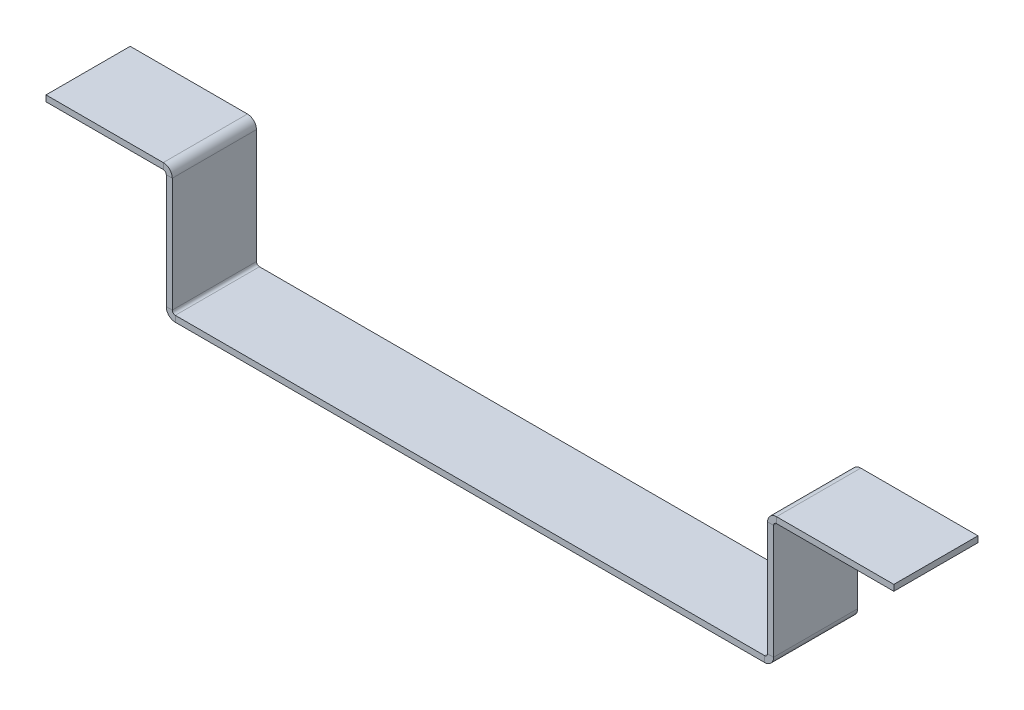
ISO-10303-21;
HEADER;
FILE_DESCRIPTION(('STEP AP214'),'2;1');
FILE_NAME('part.step','',(''),(''),'','','');
FILE_SCHEMA(('AUTOMOTIVE_DESIGN { 1 0 10303 214 1 1 1 1 }'));
ENDSEC;
DATA;
#1=APPLICATION_CONTEXT('core data for automotive mechanical design processes');
#2=APPLICATION_PROTOCOL_DEFINITION('international standard','automotive_design',2000,#1);
#3=PRODUCT_CONTEXT('',#1,'mechanical');
#4=PRODUCT('Part','Part','',(#3));
#5=PRODUCT_RELATED_PRODUCT_CATEGORY('part','',(#4));
#6=PRODUCT_DEFINITION_FORMATION('','',#4);
#7=PRODUCT_DEFINITION_CONTEXT('part definition',#1,'design');
#8=PRODUCT_DEFINITION('design','',#6,#7);
#9=PRODUCT_DEFINITION_SHAPE('','',#8);
#10=(LENGTH_UNIT() NAMED_UNIT(*) SI_UNIT(.MILLI.,.METRE.));
#11=(NAMED_UNIT(*) PLANE_ANGLE_UNIT() SI_UNIT($,.RADIAN.));
#12=(NAMED_UNIT(*) SI_UNIT($,.STERADIAN.) SOLID_ANGLE_UNIT());
#13=UNCERTAINTY_MEASURE_WITH_UNIT(LENGTH_MEASURE(1.E-05),#10,'distance_accuracy_value','');
#14=(GEOMETRIC_REPRESENTATION_CONTEXT(3) GLOBAL_UNCERTAINTY_ASSIGNED_CONTEXT((#13)) GLOBAL_UNIT_ASSIGNED_CONTEXT((#10,
#11,#12)) REPRESENTATION_CONTEXT('',''));
#15=CARTESIAN_POINT('',(0.,0.,0.));
#16=DIRECTION('',(0.,0.,1.));
#17=DIRECTION('',(1.,0.,0.));
#18=AXIS2_PLACEMENT_3D('',#15,#16,#17);
#19=CARTESIAN_POINT('',(50.5,20.5,14.0000000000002));
#20=DIRECTION('',(0.,0.,1.));
#21=DIRECTION('',(1.,0.,0.));
#22=AXIS2_PLACEMENT_3D('',#19,#20,#21);
#23=PLANE('',#22);
#24=DIRECTION('',(-1.,0.,0.));
#25=VECTOR('',#24,1.);
#26=CARTESIAN_POINT('',(50.5,20.5,14.0000000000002));
#27=LINE('',#26,#25);
#28=CARTESIAN_POINT('',(50.5,20.5,14.0000000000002));
#29=VERTEX_POINT('',#28);
#30=CARTESIAN_POINT('',(49.5,20.5,14.0000000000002));
#31=VERTEX_POINT('',#30);
#32=EDGE_CURVE('E11',#29,#31,#27,.T.);
#33=ORIENTED_EDGE('',*,*,#32,.F.);
#34=CARTESIAN_POINT('',(51.,20.5,14.0000000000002));
#35=DIRECTION('',(0.,0.,-1.));
#36=DIRECTION('',(-1.,0.,0.));
#37=AXIS2_PLACEMENT_3D('',#34,#35,#36);
#38=CIRCLE('',#37,0.5);
#39=CARTESIAN_POINT('',(51.,21.,14.0000000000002));
#40=VERTEX_POINT('',#39);
#41=EDGE_CURVE('E594',#40,#29,#38,.F.);
#42=ORIENTED_EDGE('',*,*,#41,.F.);
#43=DIRECTION('',(0.,-1.,0.));
#44=VECTOR('',#43,1.);
#45=CARTESIAN_POINT('',(51.,22.,14.0000000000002));
#46=LINE('',#45,#44);
#47=CARTESIAN_POINT('',(51.,22.,14.0000000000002));
#48=VERTEX_POINT('',#47);
#49=EDGE_CURVE('E363',#48,#40,#46,.T.);
#50=ORIENTED_EDGE('',*,*,#49,.F.);
#51=CARTESIAN_POINT('',(51.,20.5,14.0000000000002));
#52=DIRECTION('',(0.,0.,1.));
#53=DIRECTION('',(1.,0.,0.));
#54=AXIS2_PLACEMENT_3D('',#51,#52,#53);
#55=CIRCLE('',#54,1.5);
#56=EDGE_CURVE('E606',#48,#31,#55,.T.);
#57=ORIENTED_EDGE('',*,*,#56,.T.);
#58=EDGE_LOOP('',(#33,#42,#50,#57));
#59=FACE_BOUND('',#58,.T.);
#60=ADVANCED_FACE('F356',(#59),#23,.T.);
#61=CARTESIAN_POINT('',(51.,22.,14.0000000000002));
#62=DIRECTION('',(0.,0.,1.));
#63=DIRECTION('',(1.,0.,0.));
#64=AXIS2_PLACEMENT_3D('',#61,#62,#63);
#65=PLANE('',#64);
#66=DIRECTION('',(0.,-1.,0.));
#67=VECTOR('',#66,1.);
#68=CARTESIAN_POINT('',(50.5,0.,14.));
#69=LINE('',#68,#67);
#70=CARTESIAN_POINT('',(50.5,1.5,14.0000000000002));
#71=VERTEX_POINT('',#70);
#72=EDGE_CURVE('E591',#29,#71,#69,.T.);
#73=ORIENTED_EDGE('',*,*,#72,.F.);
#74=ORIENTED_EDGE('',*,*,#32,.T.);
#75=DIRECTION('',(0.,1.,0.));
#76=VECTOR('',#75,1.);
#77=CARTESIAN_POINT('',(49.5,0.,14.));
#78=LINE('',#77,#76);
#79=CARTESIAN_POINT('',(49.5,1.5,14.));
#80=VERTEX_POINT('',#79);
#81=EDGE_CURVE('E609',#31,#80,#78,.F.);
#82=ORIENTED_EDGE('',*,*,#81,.T.);
#83=DIRECTION('',(1.,0.,0.));
#84=VECTOR('',#83,1.);
#85=CARTESIAN_POINT('',(49.5,1.5,14.));
#86=LINE('',#85,#84);
#87=EDGE_CURVE('E693',#80,#71,#86,.T.);
#88=ORIENTED_EDGE('',*,*,#87,.T.);
#89=EDGE_LOOP('',(#73,#74,#82,#88));
#90=FACE_BOUND('',#89,.T.);
#91=ADVANCED_FACE('F735',(#90),#65,.T.);
#92=CARTESIAN_POINT('',(51.,21.,1.66533453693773E-13));
#93=DIRECTION('',(0.,0.,-1.));
#94=DIRECTION('',(-1.,0.,0.));
#95=AXIS2_PLACEMENT_3D('',#92,#93,#94);
#96=PLANE('',#95);
#97=DIRECTION('',(0.,1.,0.));
#98=VECTOR('',#97,1.);
#99=CARTESIAN_POINT('',(51.,21.,1.66533453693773E-13));
#100=LINE('',#99,#98);
#101=CARTESIAN_POINT('',(51.,21.,1.66533453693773E-13));
#102=VERTEX_POINT('',#101);
#103=CARTESIAN_POINT('',(51.,22.,1.66533453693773E-13));
#104=VERTEX_POINT('',#103);
#105=EDGE_CURVE('E699',#102,#104,#100,.T.);
#106=ORIENTED_EDGE('',*,*,#105,.F.);
#107=CARTESIAN_POINT('',(51.,20.5,1.66533453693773E-13));
#108=DIRECTION('',(0.,0.,-1.));
#109=DIRECTION('',(-1.,0.,0.));
#110=AXIS2_PLACEMENT_3D('',#107,#108,#109);
#111=CIRCLE('',#110,0.5);
#112=CARTESIAN_POINT('',(50.5,20.5,1.66533453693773E-13));
#113=VERTEX_POINT('',#112);
#114=EDGE_CURVE('E537',#102,#113,#111,.F.);
#115=ORIENTED_EDGE('',*,*,#114,.T.);
#116=DIRECTION('',(1.,0.,0.));
#117=VECTOR('',#116,1.);
#118=CARTESIAN_POINT('',(49.5,20.5,1.66533453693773E-13));
#119=LINE('',#118,#117);
#120=CARTESIAN_POINT('',(49.5,20.5,1.66533453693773E-13));
#121=VERTEX_POINT('',#120);
#122=EDGE_CURVE('E697',#121,#113,#119,.T.);
#123=ORIENTED_EDGE('',*,*,#122,.F.);
#124=CARTESIAN_POINT('',(51.,20.5,1.66533453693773E-13));
#125=DIRECTION('',(0.,0.,1.));
#126=DIRECTION('',(1.,0.,0.));
#127=AXIS2_PLACEMENT_3D('',#124,#125,#126);
#128=CIRCLE('',#127,1.5);
#129=EDGE_CURVE('E549',#104,#121,#128,.T.);
#130=ORIENTED_EDGE('',*,*,#129,.F.);
#131=EDGE_LOOP('',(#106,#115,#123,#130));
#132=FACE_BOUND('',#131,.T.);
#133=ADVANCED_FACE('F743',(#132),#96,.T.);
#134=CARTESIAN_POINT('',(49.5,20.5,1.66533453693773E-13));
#135=DIRECTION('',(0.,0.,-1.));
#136=DIRECTION('',(-1.,0.,0.));
#137=AXIS2_PLACEMENT_3D('',#134,#135,#136);
#138=PLANE('',#137);
#139=DIRECTION('',(-1.,0.,0.));
#140=VECTOR('',#139,1.);
#141=CARTESIAN_POINT('',(50.5,21.,1.66533453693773E-13));
#142=LINE('',#141,#140);
#143=CARTESIAN_POINT('',(70.5,21.,1.66533453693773E-13));
#144=VERTEX_POINT('',#143);
#145=EDGE_CURVE('E540',#144,#102,#142,.T.);
#146=ORIENTED_EDGE('',*,*,#145,.T.);
#147=ORIENTED_EDGE('',*,*,#105,.T.);
#148=DIRECTION('',(1.,0.,0.));
#149=VECTOR('',#148,1.);
#150=CARTESIAN_POINT('',(50.5,22.,1.66533453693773E-13));
#151=LINE('',#150,#149);
#152=CARTESIAN_POINT('',(70.5,22.,1.66533453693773E-13));
#153=VERTEX_POINT('',#152);
#154=EDGE_CURVE('E546',#153,#104,#151,.F.);
#155=ORIENTED_EDGE('',*,*,#154,.F.);
#156=DIRECTION('',(0.,-1.,0.));
#157=VECTOR('',#156,1.);
#158=CARTESIAN_POINT('',(70.5,22.,1.66533453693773E-13));
#159=LINE('',#158,#157);
#160=EDGE_CURVE('E543',#153,#144,#159,.T.);
#161=ORIENTED_EDGE('',*,*,#160,.T.);
#162=EDGE_LOOP('',(#146,#147,#155,#161));
#163=FACE_BOUND('',#162,.T.);
#164=ADVANCED_FACE('F745',(#163),#138,.T.);
#165=CARTESIAN_POINT('',(48.9999999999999,0.,14.));
#166=DIRECTION('',(0.,0.,1.));
#167=DIRECTION('',(1.,0.,0.));
#168=AXIS2_PLACEMENT_3D('',#165,#166,#167);
#169=PLANE('',#168);
#170=DIRECTION('',(0.,1.,0.));
#171=VECTOR('',#170,1.);
#172=CARTESIAN_POINT('',(48.9999999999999,0.,14.));
#173=LINE('',#172,#171);
#174=CARTESIAN_POINT('',(48.9999999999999,0.,14.));
#175=VERTEX_POINT('',#174);
#176=CARTESIAN_POINT('',(48.9999999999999,1.,14.));
#177=VERTEX_POINT('',#176);
#178=EDGE_CURVE('E695',#175,#177,#173,.T.);
#179=ORIENTED_EDGE('',*,*,#178,.F.);
#180=CARTESIAN_POINT('',(49.,1.5,14.));
#181=DIRECTION('',(0.,0.,1.));
#182=DIRECTION('',(1.,0.,0.));
#183=AXIS2_PLACEMENT_3D('',#180,#181,#182);
#184=CIRCLE('',#183,1.5);
#185=EDGE_CURVE('E588',#71,#175,#184,.F.);
#186=ORIENTED_EDGE('',*,*,#185,.F.);
#187=ORIENTED_EDGE('',*,*,#87,.F.);
#188=CARTESIAN_POINT('',(49.,1.5,14.));
#189=DIRECTION('',(0.,0.,1.));
#190=DIRECTION('',(1.,0.,0.));
#191=AXIS2_PLACEMENT_3D('',#188,#189,#190);
#192=CIRCLE('',#191,0.5);
#193=EDGE_CURVE('E612',#80,#177,#192,.F.);
#194=ORIENTED_EDGE('',*,*,#193,.T.);
#195=EDGE_LOOP('',(#179,#186,#187,#194));
#196=FACE_BOUND('',#195,.T.);
#197=ADVANCED_FACE('F747',(#196),#169,.T.);
#198=CARTESIAN_POINT('',(49.5,1.5,14.));
#199=DIRECTION('',(0.,0.,1.));
#200=DIRECTION('',(1.,0.,0.));
#201=AXIS2_PLACEMENT_3D('',#198,#199,#200);
#202=PLANE('',#201);
#203=DIRECTION('',(-1.,0.,0.));
#204=VECTOR('',#203,1.);
#205=CARTESIAN_POINT('',(-50.5,0.,14.));
#206=LINE('',#205,#204);
#207=CARTESIAN_POINT('',(-49.,0.,14.));
#208=VERTEX_POINT('',#207);
#209=EDGE_CURVE('E585',#175,#208,#206,.T.);
#210=ORIENTED_EDGE('',*,*,#209,.F.);
#211=ORIENTED_EDGE('',*,*,#178,.T.);
#212=DIRECTION('',(-1.,0.,0.));
#213=VECTOR('',#212,1.);
#214=CARTESIAN_POINT('',(-50.5,1.,14.));
#215=LINE('',#214,#213);
#216=CARTESIAN_POINT('',(-49.,1.,14.));
#217=VERTEX_POINT('',#216);
#218=EDGE_CURVE('E615',#177,#217,#215,.T.);
#219=ORIENTED_EDGE('',*,*,#218,.T.);
#220=DIRECTION('',(0.,-1.,0.));
#221=VECTOR('',#220,1.);
#222=CARTESIAN_POINT('',(-49.,1.,14.));
#223=LINE('',#222,#221);
#224=EDGE_CURVE('E685',#217,#208,#223,.T.);
#225=ORIENTED_EDGE('',*,*,#224,.T.);
#226=EDGE_LOOP('',(#210,#211,#219,#225));
#227=FACE_BOUND('',#226,.T.);
#228=ADVANCED_FACE('F753',(#227),#202,.T.);
#229=CARTESIAN_POINT('',(50.5,1.5,1.66533453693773E-13));
#230=DIRECTION('',(0.,0.,-1.));
#231=DIRECTION('',(-1.,0.,0.));
#232=AXIS2_PLACEMENT_3D('',#229,#230,#231);
#233=PLANE('',#232);
#234=DIRECTION('',(-1.,0.,0.));
#235=VECTOR('',#234,1.);
#236=CARTESIAN_POINT('',(50.5,1.5,1.66533453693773E-13));
#237=LINE('',#236,#235);
#238=CARTESIAN_POINT('',(50.5,1.5,1.66533453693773E-13));
#239=VERTEX_POINT('',#238);
#240=CARTESIAN_POINT('',(49.5,1.5,1.66533453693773E-13));
#241=VERTEX_POINT('',#240);
#242=EDGE_CURVE('E691',#239,#241,#237,.T.);
#243=ORIENTED_EDGE('',*,*,#242,.F.);
#244=CARTESIAN_POINT('',(49.,1.5,1.66533453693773E-13));
#245=DIRECTION('',(0.,0.,1.));
#246=DIRECTION('',(1.,0.,0.));
#247=AXIS2_PLACEMENT_3D('',#244,#245,#246);
#248=CIRCLE('',#247,1.5);
#249=CARTESIAN_POINT('',(48.9999999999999,0.,0.));
#250=VERTEX_POINT('',#249);
#251=EDGE_CURVE('E531',#239,#250,#248,.F.);
#252=ORIENTED_EDGE('',*,*,#251,.T.);
#253=DIRECTION('',(0.,-1.,0.));
#254=VECTOR('',#253,1.);
#255=CARTESIAN_POINT('',(48.9999999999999,1.,0.));
#256=LINE('',#255,#254);
#257=CARTESIAN_POINT('',(48.9999999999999,1.,0.));
#258=VERTEX_POINT('',#257);
#259=EDGE_CURVE('E689',#258,#250,#256,.T.);
#260=ORIENTED_EDGE('',*,*,#259,.F.);
#261=CARTESIAN_POINT('',(49.,1.5,1.66533453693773E-13));
#262=DIRECTION('',(0.,0.,1.));
#263=DIRECTION('',(1.,0.,0.));
#264=AXIS2_PLACEMENT_3D('',#261,#262,#263);
#265=CIRCLE('',#264,0.5);
#266=EDGE_CURVE('E555',#241,#258,#265,.F.);
#267=ORIENTED_EDGE('',*,*,#266,.F.);
#268=EDGE_LOOP('',(#243,#252,#260,#267));
#269=FACE_BOUND('',#268,.T.);
#270=ADVANCED_FACE('F792',(#269),#233,.T.);
#271=CARTESIAN_POINT('',(48.9999999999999,1.,0.));
#272=DIRECTION('',(0.,0.,-1.));
#273=DIRECTION('',(-1.,0.,0.));
#274=AXIS2_PLACEMENT_3D('',#271,#272,#273);
#275=PLANE('',#274);
#276=DIRECTION('',(0.,-1.,0.));
#277=VECTOR('',#276,1.);
#278=CARTESIAN_POINT('',(50.5,0.,0.));
#279=LINE('',#278,#277);
#280=EDGE_CURVE('E534',#113,#239,#279,.T.);
#281=ORIENTED_EDGE('',*,*,#280,.T.);
#282=ORIENTED_EDGE('',*,*,#242,.T.);
#283=DIRECTION('',(0.,1.,0.));
#284=VECTOR('',#283,1.);
#285=CARTESIAN_POINT('',(49.5,0.,0.));
#286=LINE('',#285,#284);
#287=EDGE_CURVE('E552',#121,#241,#286,.F.);
#288=ORIENTED_EDGE('',*,*,#287,.F.);
#289=ORIENTED_EDGE('',*,*,#122,.T.);
#290=EDGE_LOOP('',(#281,#282,#288,#289));
#291=FACE_BOUND('',#290,.T.);
#292=ADVANCED_FACE('F802',(#291),#275,.T.);
#293=CARTESIAN_POINT('',(-50.5,1.5,14.));
#294=DIRECTION('',(0.,0.,1.));
#295=DIRECTION('',(1.,0.,0.));
#296=AXIS2_PLACEMENT_3D('',#293,#294,#295);
#297=PLANE('',#296);
#298=DIRECTION('',(1.,0.,0.));
#299=VECTOR('',#298,1.);
#300=CARTESIAN_POINT('',(-50.5,1.5,14.));
#301=LINE('',#300,#299);
#302=CARTESIAN_POINT('',(-50.5,1.5,14.));
#303=VERTEX_POINT('',#302);
#304=CARTESIAN_POINT('',(-49.5,1.5,14.));
#305=VERTEX_POINT('',#304);
#306=EDGE_CURVE('E687',#303,#305,#301,.T.);
#307=ORIENTED_EDGE('',*,*,#306,.F.);
#308=CARTESIAN_POINT('',(-49.,1.5,14.));
#309=DIRECTION('',(0.,0.,1.));
#310=DIRECTION('',(1.,0.,0.));
#311=AXIS2_PLACEMENT_3D('',#308,#309,#310);
#312=CIRCLE('',#311,1.5);
#313=EDGE_CURVE('E582',#208,#303,#312,.F.);
#314=ORIENTED_EDGE('',*,*,#313,.F.);
#315=ORIENTED_EDGE('',*,*,#224,.F.);
#316=CARTESIAN_POINT('',(-49.,1.5,14.));
#317=DIRECTION('',(0.,0.,1.));
#318=DIRECTION('',(1.,0.,0.));
#319=AXIS2_PLACEMENT_3D('',#316,#317,#318);
#320=CIRCLE('',#319,0.5);
#321=EDGE_CURVE('E618',#217,#305,#320,.F.);
#322=ORIENTED_EDGE('',*,*,#321,.T.);
#323=EDGE_LOOP('',(#307,#314,#315,#322));
#324=FACE_BOUND('',#323,.T.);
#325=ADVANCED_FACE('F812',(#324),#297,.T.);
#326=CARTESIAN_POINT('',(-49.,1.,14.));
#327=DIRECTION('',(0.,0.,1.));
#328=DIRECTION('',(1.,0.,0.));
#329=AXIS2_PLACEMENT_3D('',#326,#327,#328);
#330=PLANE('',#329);
#331=DIRECTION('',(0.,1.,0.));
#332=VECTOR('',#331,1.);
#333=CARTESIAN_POINT('',(-50.5,0.,14.));
#334=LINE('',#333,#332);
#335=CARTESIAN_POINT('',(-50.5,20.5,14.));
#336=VERTEX_POINT('',#335);
#337=EDGE_CURVE('E579',#303,#336,#334,.T.);
#338=ORIENTED_EDGE('',*,*,#337,.F.);
#339=ORIENTED_EDGE('',*,*,#306,.T.);
#340=DIRECTION('',(0.,1.,0.));
#341=VECTOR('',#340,1.);
#342=CARTESIAN_POINT('',(-49.5,0.,14.));
#343=LINE('',#342,#341);
#344=CARTESIAN_POINT('',(-49.5,20.5,14.));
#345=VERTEX_POINT('',#344);
#346=EDGE_CURVE('E621',#305,#345,#343,.T.);
#347=ORIENTED_EDGE('',*,*,#346,.T.);
#348=DIRECTION('',(-1.,0.,0.));
#349=VECTOR('',#348,1.);
#350=CARTESIAN_POINT('',(-49.5,20.5,14.));
#351=LINE('',#350,#349);
#352=EDGE_CURVE('E377',#345,#336,#351,.T.);
#353=ORIENTED_EDGE('',*,*,#352,.T.);
#354=EDGE_LOOP('',(#338,#339,#347,#353));
#355=FACE_BOUND('',#354,.T.);
#356=ADVANCED_FACE('F822',(#355),#330,.T.);
#357=CARTESIAN_POINT('',(-49.,0.,0.));
#358=DIRECTION('',(0.,0.,-1.));
#359=DIRECTION('',(-1.,0.,0.));
#360=AXIS2_PLACEMENT_3D('',#357,#358,#359);
#361=PLANE('',#360);
#362=DIRECTION('',(0.,1.,0.));
#363=VECTOR('',#362,1.);
#364=CARTESIAN_POINT('',(-49.,0.,0.));
#365=LINE('',#364,#363);
#366=CARTESIAN_POINT('',(-49.,0.,0.));
#367=VERTEX_POINT('',#366);
#368=CARTESIAN_POINT('',(-49.,1.,0.));
#369=VERTEX_POINT('',#368);
#370=EDGE_CURVE('E683',#367,#369,#365,.T.);
#371=ORIENTED_EDGE('',*,*,#370,.F.);
#372=CARTESIAN_POINT('',(-49.,1.5,0.));
#373=DIRECTION('',(0.,0.,1.));
#374=DIRECTION('',(1.,0.,0.));
#375=AXIS2_PLACEMENT_3D('',#372,#373,#374);
#376=CIRCLE('',#375,1.5);
#377=CARTESIAN_POINT('',(-50.5,1.5,0.));
#378=VERTEX_POINT('',#377);
#379=EDGE_CURVE('E525',#367,#378,#376,.F.);
#380=ORIENTED_EDGE('',*,*,#379,.T.);
#381=DIRECTION('',(-1.,0.,0.));
#382=VECTOR('',#381,1.);
#383=CARTESIAN_POINT('',(-49.5,1.5,0.));
#384=LINE('',#383,#382);
#385=CARTESIAN_POINT('',(-49.5,1.5,0.));
#386=VERTEX_POINT('',#385);
#387=EDGE_CURVE('E681',#386,#378,#384,.T.);
#388=ORIENTED_EDGE('',*,*,#387,.F.);
#389=CARTESIAN_POINT('',(-49.,1.5,0.));
#390=DIRECTION('',(0.,0.,1.));
#391=DIRECTION('',(1.,0.,0.));
#392=AXIS2_PLACEMENT_3D('',#389,#390,#391);
#393=CIRCLE('',#392,0.5);
#394=EDGE_CURVE('E561',#369,#386,#393,.F.);
#395=ORIENTED_EDGE('',*,*,#394,.F.);
#396=EDGE_LOOP('',(#371,#380,#388,#395));
#397=FACE_BOUND('',#396,.T.);
#398=ADVANCED_FACE('F833',(#397),#361,.T.);
#399=CARTESIAN_POINT('',(-49.5,1.5,0.));
#400=DIRECTION('',(0.,0.,-1.));
#401=DIRECTION('',(-1.,0.,0.));
#402=AXIS2_PLACEMENT_3D('',#399,#400,#401);
#403=PLANE('',#402);
#404=DIRECTION('',(-1.,0.,0.));
#405=VECTOR('',#404,1.);
#406=CARTESIAN_POINT('',(-50.5,0.,0.));
#407=LINE('',#406,#405);
#408=EDGE_CURVE('E528',#250,#367,#407,.T.);
#409=ORIENTED_EDGE('',*,*,#408,.T.);
#410=ORIENTED_EDGE('',*,*,#370,.T.);
#411=DIRECTION('',(-1.,0.,0.));
#412=VECTOR('',#411,1.);
#413=CARTESIAN_POINT('',(-50.5,1.,0.));
#414=LINE('',#413,#412);
#415=EDGE_CURVE('E558',#258,#369,#414,.T.);
#416=ORIENTED_EDGE('',*,*,#415,.F.);
#417=ORIENTED_EDGE('',*,*,#259,.T.);
#418=EDGE_LOOP('',(#409,#410,#416,#417));
#419=FACE_BOUND('',#418,.T.);
#420=ADVANCED_FACE('F843',(#419),#403,.T.);
#421=CARTESIAN_POINT('',(-51.,21.,14.));
#422=DIRECTION('',(0.,0.,1.));
#423=DIRECTION('',(1.,0.,0.));
#424=AXIS2_PLACEMENT_3D('',#421,#422,#423);
#425=PLANE('',#424);
#426=DIRECTION('',(0.,1.,0.));
#427=VECTOR('',#426,1.);
#428=CARTESIAN_POINT('',(-51.,21.,14.));
#429=LINE('',#428,#427);
#430=CARTESIAN_POINT('',(-51.,21.,14.));
#431=VERTEX_POINT('',#430);
#432=CARTESIAN_POINT('',(-51.,22.,14.));
#433=VERTEX_POINT('',#432);
#434=EDGE_CURVE('E370',#431,#433,#429,.T.);
#435=ORIENTED_EDGE('',*,*,#434,.F.);
#436=CARTESIAN_POINT('',(-51.,20.5,14.));
#437=DIRECTION('',(0.,0.,-1.));
#438=DIRECTION('',(-1.,0.,0.));
#439=AXIS2_PLACEMENT_3D('',#436,#437,#438);
#440=CIRCLE('',#439,0.5);
#441=EDGE_CURVE('E576',#336,#431,#440,.F.);
#442=ORIENTED_EDGE('',*,*,#441,.F.);
#443=ORIENTED_EDGE('',*,*,#352,.F.);
#444=CARTESIAN_POINT('',(-51.,20.5,14.));
#445=DIRECTION('',(0.,0.,1.));
#446=DIRECTION('',(1.,0.,0.));
#447=AXIS2_PLACEMENT_3D('',#444,#445,#446);
#448=CIRCLE('',#447,1.5);
#449=EDGE_CURVE('E623',#345,#433,#448,.T.);
#450=ORIENTED_EDGE('',*,*,#449,.T.);
#451=EDGE_LOOP('',(#435,#442,#443,#450));
#452=FACE_BOUND('',#451,.T.);
#453=ADVANCED_FACE('F853',(#452),#425,.T.);
#454=CARTESIAN_POINT('',(-49.5,20.5,14.));
#455=DIRECTION('',(0.,0.,1.));
#456=DIRECTION('',(1.,0.,0.));
#457=AXIS2_PLACEMENT_3D('',#454,#455,#456);
#458=PLANE('',#457);
#459=DIRECTION('',(-1.,0.,0.));
#460=VECTOR('',#459,1.);
#461=CARTESIAN_POINT('',(-50.5,21.,14.));
#462=LINE('',#461,#460);
#463=CARTESIAN_POINT('',(-70.5,21.,14.));
#464=VERTEX_POINT('',#463);
#465=EDGE_CURVE('E573',#431,#464,#462,.T.);
#466=ORIENTED_EDGE('',*,*,#465,.F.);
#467=ORIENTED_EDGE('',*,*,#434,.T.);
#468=DIRECTION('',(-1.,0.,0.));
#469=VECTOR('',#468,1.);
#470=CARTESIAN_POINT('',(-50.5,22.,14.));
#471=LINE('',#470,#469);
#472=CARTESIAN_POINT('',(-70.5,22.,14.));
#473=VERTEX_POINT('',#472);
#474=EDGE_CURVE('E570',#433,#473,#471,.T.);
#475=ORIENTED_EDGE('',*,*,#474,.T.);
#476=DIRECTION('',(0.,1.,0.));
#477=VECTOR('',#476,1.);
#478=CARTESIAN_POINT('',(-70.5,21.,14.));
#479=LINE('',#478,#477);
#480=EDGE_CURVE('E499',#464,#473,#479,.T.);
#481=ORIENTED_EDGE('',*,*,#480,.F.);
#482=EDGE_LOOP('',(#466,#467,#475,#481));
#483=FACE_BOUND('',#482,.T.);
#484=ADVANCED_FACE('F864',(#483),#458,.T.);
#485=CARTESIAN_POINT('',(-50.5,20.5,0.));
#486=DIRECTION('',(0.,0.,-1.));
#487=DIRECTION('',(-1.,0.,0.));
#488=AXIS2_PLACEMENT_3D('',#485,#486,#487);
#489=PLANE('',#488);
#490=DIRECTION('',(1.,0.,0.));
#491=VECTOR('',#490,1.);
#492=CARTESIAN_POINT('',(-50.5,20.5,0.));
#493=LINE('',#492,#491);
#494=CARTESIAN_POINT('',(-50.5,20.5,0.));
#495=VERTEX_POINT('',#494);
#496=CARTESIAN_POINT('',(-49.5,20.5,0.));
#497=VERTEX_POINT('',#496);
#498=EDGE_CURVE('E677',#495,#497,#493,.T.);
#499=ORIENTED_EDGE('',*,*,#498,.F.);
#500=CARTESIAN_POINT('',(-51.,20.5,0.));
#501=DIRECTION('',(0.,0.,-1.));
#502=DIRECTION('',(-1.,0.,0.));
#503=AXIS2_PLACEMENT_3D('',#500,#501,#502);
#504=CIRCLE('',#503,0.5);
#505=CARTESIAN_POINT('',(-51.,21.,0.));
#506=VERTEX_POINT('',#505);
#507=EDGE_CURVE('E517',#495,#506,#504,.F.);
#508=ORIENTED_EDGE('',*,*,#507,.T.);
#509=DIRECTION('',(0.,-1.,0.));
#510=VECTOR('',#509,1.);
#511=CARTESIAN_POINT('',(-51.,22.,0.));
#512=LINE('',#511,#510);
#513=CARTESIAN_POINT('',(-51.,22.,0.));
#514=VERTEX_POINT('',#513);
#515=EDGE_CURVE('E502',#514,#506,#512,.T.);
#516=ORIENTED_EDGE('',*,*,#515,.F.);
#517=CARTESIAN_POINT('',(-51.,20.5,0.));
#518=DIRECTION('',(0.,0.,1.));
#519=DIRECTION('',(1.,0.,0.));
#520=AXIS2_PLACEMENT_3D('',#517,#518,#519);
#521=CIRCLE('',#520,1.5);
#522=EDGE_CURVE('E567',#497,#514,#521,.T.);
#523=ORIENTED_EDGE('',*,*,#522,.F.);
#524=EDGE_LOOP('',(#499,#508,#516,#523));
#525=FACE_BOUND('',#524,.T.);
#526=ADVANCED_FACE('F874',(#525),#489,.T.);
#527=CARTESIAN_POINT('',(-51.,22.,0.));
#528=DIRECTION('',(0.,0.,-1.));
#529=DIRECTION('',(-1.,0.,0.));
#530=AXIS2_PLACEMENT_3D('',#527,#528,#529);
#531=PLANE('',#530);
#532=DIRECTION('',(0.,1.,0.));
#533=VECTOR('',#532,1.);
#534=CARTESIAN_POINT('',(-50.5,0.,0.));
#535=LINE('',#534,#533);
#536=EDGE_CURVE('E522',#378,#495,#535,.T.);
#537=ORIENTED_EDGE('',*,*,#536,.T.);
#538=ORIENTED_EDGE('',*,*,#498,.T.);
#539=DIRECTION('',(0.,1.,0.));
#540=VECTOR('',#539,1.);
#541=CARTESIAN_POINT('',(-49.5,0.,0.));
#542=LINE('',#541,#540);
#543=EDGE_CURVE('E564',#386,#497,#542,.T.);
#544=ORIENTED_EDGE('',*,*,#543,.F.);
#545=ORIENTED_EDGE('',*,*,#387,.T.);
#546=EDGE_LOOP('',(#537,#538,#544,#545));
#547=FACE_BOUND('',#546,.T.);
#548=ADVANCED_FACE('F883',(#547),#531,.T.);
#549=CARTESIAN_POINT('',(-50.5,22.,14.));
#550=DIRECTION('',(0.,-1.,0.));
#551=DIRECTION('',(1.,0.,0.));
#552=AXIS2_PLACEMENT_3D('',#549,#550,#551);
#553=PLANE('',#552);
#554=DIRECTION('',(-1.,0.,0.));
#555=VECTOR('',#554,1.);
#556=CARTESIAN_POINT('',(-50.5,22.,0.));
#557=LINE('',#556,#555);
#558=CARTESIAN_POINT('',(-70.5,22.,0.));
#559=VERTEX_POINT('',#558);
#560=EDGE_CURVE('E507',#514,#559,#557,.T.);
#561=ORIENTED_EDGE('',*,*,#560,.T.);
#562=DIRECTION('',(0.,0.,-1.));
#563=VECTOR('',#562,1.);
#564=CARTESIAN_POINT('',(-70.5,22.,14.));
#565=LINE('',#564,#563);
#566=EDGE_CURVE('E492',#473,#559,#565,.T.);
#567=ORIENTED_EDGE('',*,*,#566,.F.);
#568=ORIENTED_EDGE('',*,*,#474,.F.);
#569=DIRECTION('',(0.,0.,-1.));
#570=VECTOR('',#569,1.);
#571=CARTESIAN_POINT('',(-51.,22.,14.));
#572=LINE('',#571,#570);
#573=EDGE_CURVE('E510',#433,#514,#572,.T.);
#574=ORIENTED_EDGE('',*,*,#573,.T.);
#575=EDGE_LOOP('',(#561,#567,#568,#574));
#576=FACE_BOUND('',#575,.T.);
#577=ADVANCED_FACE('F508',(#576),#553,.F.);
#578=CARTESIAN_POINT('',(-70.5,21.,14.));
#579=DIRECTION('',(-1.,0.,0.));
#580=DIRECTION('',(0.,0.,1.));
#581=AXIS2_PLACEMENT_3D('',#578,#579,#580);
#582=PLANE('',#581);
#583=DIRECTION('',(0.,1.,0.));
#584=VECTOR('',#583,1.);
#585=CARTESIAN_POINT('',(-70.5,21.,0.));
#586=LINE('',#585,#584);
#587=CARTESIAN_POINT('',(-70.5,21.,0.));
#588=VERTEX_POINT('',#587);
#589=EDGE_CURVE('E496',#588,#559,#586,.T.);
#590=ORIENTED_EDGE('',*,*,#589,.F.);
#591=DIRECTION('',(0.,0.,-1.));
#592=VECTOR('',#591,1.);
#593=CARTESIAN_POINT('',(-70.5,21.,14.));
#594=LINE('',#593,#592);
#595=EDGE_CURVE('E503',#464,#588,#594,.T.);
#596=ORIENTED_EDGE('',*,*,#595,.F.);
#597=ORIENTED_EDGE('',*,*,#480,.T.);
#598=ORIENTED_EDGE('',*,*,#566,.T.);
#599=EDGE_LOOP('',(#590,#596,#597,#598));
#600=FACE_BOUND('',#599,.T.);
#601=ADVANCED_FACE('F494',(#600),#582,.T.);
#602=CARTESIAN_POINT('',(-50.5,21.,14.));
#603=DIRECTION('',(0.,-1.,0.));
#604=DIRECTION('',(1.,0.,0.));
#605=AXIS2_PLACEMENT_3D('',#602,#603,#604);
#606=PLANE('',#605);
#607=DIRECTION('',(-1.,0.,0.));
#608=VECTOR('',#607,1.);
#609=CARTESIAN_POINT('',(-50.5,21.,0.));
#610=LINE('',#609,#608);
#611=EDGE_CURVE('E515',#506,#588,#610,.T.);
#612=ORIENTED_EDGE('',*,*,#611,.F.);
#613=DIRECTION('',(0.,0.,-1.));
#614=VECTOR('',#613,1.);
#615=CARTESIAN_POINT('',(-51.,21.,14.));
#616=LINE('',#615,#614);
#617=EDGE_CURVE('E672',#431,#506,#616,.T.);
#618=ORIENTED_EDGE('',*,*,#617,.F.);
#619=ORIENTED_EDGE('',*,*,#465,.T.);
#620=ORIENTED_EDGE('',*,*,#595,.T.);
#621=EDGE_LOOP('',(#612,#618,#619,#620));
#622=FACE_BOUND('',#621,.T.);
#623=ADVANCED_FACE('F910',(#622),#606,.T.);
#624=CARTESIAN_POINT('',(-51.,20.5,14.));
#625=DIRECTION('',(0.,0.,-1.));
#626=DIRECTION('',(-1.,0.,0.));
#627=AXIS2_PLACEMENT_3D('',#624,#625,#626);
#628=CYLINDRICAL_SURFACE('',#627,0.5);
#629=ORIENTED_EDGE('',*,*,#507,.F.);
#630=DIRECTION('',(0.,0.,-1.));
#631=VECTOR('',#630,1.);
#632=CARTESIAN_POINT('',(-50.5,20.5,14.));
#633=LINE('',#632,#631);
#634=EDGE_CURVE('E669',#336,#495,#633,.T.);
#635=ORIENTED_EDGE('',*,*,#634,.F.);
#636=ORIENTED_EDGE('',*,*,#441,.T.);
#637=ORIENTED_EDGE('',*,*,#617,.T.);
#638=EDGE_LOOP('',(#629,#635,#636,#637));
#639=FACE_BOUND('',#638,.T.);
#640=ADVANCED_FACE('F919',(#639),#628,.F.);
#641=CARTESIAN_POINT('',(-50.5,0.,14.));
#642=DIRECTION('',(-1.,0.,0.));
#643=DIRECTION('',(0.,-1.,0.));
#644=AXIS2_PLACEMENT_3D('',#641,#642,#643);
#645=PLANE('',#644);
#646=ORIENTED_EDGE('',*,*,#536,.F.);
#647=DIRECTION('',(0.,0.,-1.));
#648=VECTOR('',#647,1.);
#649=CARTESIAN_POINT('',(-50.5,1.5,14.));
#650=LINE('',#649,#648);
#651=EDGE_CURVE('E666',#303,#378,#650,.T.);
#652=ORIENTED_EDGE('',*,*,#651,.F.);
#653=ORIENTED_EDGE('',*,*,#337,.T.);
#654=ORIENTED_EDGE('',*,*,#634,.T.);
#655=EDGE_LOOP('',(#646,#652,#653,#654));
#656=FACE_BOUND('',#655,.T.);
#657=ADVANCED_FACE('F930',(#656),#645,.T.);
#658=CARTESIAN_POINT('',(-49.,1.5,14.));
#659=DIRECTION('',(0.,0.,-1.));
#660=DIRECTION('',(-1.,0.,0.));
#661=AXIS2_PLACEMENT_3D('',#658,#659,#660);
#662=CYLINDRICAL_SURFACE('',#661,1.5);
#663=ORIENTED_EDGE('',*,*,#379,.F.);
#664=DIRECTION('',(0.,0.,-1.));
#665=VECTOR('',#664,1.);
#666=CARTESIAN_POINT('',(-49.,0.,14.));
#667=LINE('',#666,#665);
#668=EDGE_CURVE('E663',#208,#367,#667,.T.);
#669=ORIENTED_EDGE('',*,*,#668,.F.);
#670=ORIENTED_EDGE('',*,*,#313,.T.);
#671=ORIENTED_EDGE('',*,*,#651,.T.);
#672=EDGE_LOOP('',(#663,#669,#670,#671));
#673=FACE_BOUND('',#672,.T.);
#674=ADVANCED_FACE('F940',(#673),#662,.T.);
#675=CARTESIAN_POINT('',(-50.5,0.,14.));
#676=DIRECTION('',(0.,-1.,0.));
#677=DIRECTION('',(1.,0.,0.));
#678=AXIS2_PLACEMENT_3D('',#675,#676,#677);
#679=PLANE('',#678);
#680=ORIENTED_EDGE('',*,*,#408,.F.);
#681=DIRECTION('',(0.,0.,-1.));
#682=VECTOR('',#681,1.);
#683=CARTESIAN_POINT('',(48.9999999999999,0.,14.));
#684=LINE('',#683,#682);
#685=EDGE_CURVE('E660',#175,#250,#684,.T.);
#686=ORIENTED_EDGE('',*,*,#685,.F.);
#687=ORIENTED_EDGE('',*,*,#209,.T.);
#688=ORIENTED_EDGE('',*,*,#668,.T.);
#689=EDGE_LOOP('',(#680,#686,#687,#688));
#690=FACE_BOUND('',#689,.T.);
#691=ADVANCED_FACE('F950',(#690),#679,.T.);
#692=CARTESIAN_POINT('',(49.,1.5,14.));
#693=DIRECTION('',(0.,0.,-1.));
#694=DIRECTION('',(-1.,0.,0.));
#695=AXIS2_PLACEMENT_3D('',#692,#693,#694);
#696=CYLINDRICAL_SURFACE('',#695,1.5);
#697=ORIENTED_EDGE('',*,*,#251,.F.);
#698=DIRECTION('',(0.,0.,-1.));
#699=VECTOR('',#698,1.);
#700=CARTESIAN_POINT('',(50.5,1.5,14.0000000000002));
#701=LINE('',#700,#699);
#702=EDGE_CURVE('E657',#71,#239,#701,.T.);
#703=ORIENTED_EDGE('',*,*,#702,.F.);
#704=ORIENTED_EDGE('',*,*,#185,.T.);
#705=ORIENTED_EDGE('',*,*,#685,.T.);
#706=EDGE_LOOP('',(#697,#703,#704,#705));
#707=FACE_BOUND('',#706,.T.);
#708=ADVANCED_FACE('F959',(#707),#696,.T.);
#709=CARTESIAN_POINT('',(50.5,0.,14.));
#710=DIRECTION('',(1.,0.,0.));
#711=DIRECTION('',(0.,0.,-1.));
#712=AXIS2_PLACEMENT_3D('',#709,#710,#711);
#713=PLANE('',#712);
#714=ORIENTED_EDGE('',*,*,#280,.F.);
#715=DIRECTION('',(0.,0.,-1.));
#716=VECTOR('',#715,1.);
#717=CARTESIAN_POINT('',(50.5,20.5,14.0000000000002));
#718=LINE('',#717,#716);
#719=EDGE_CURVE('E654',#29,#113,#718,.T.);
#720=ORIENTED_EDGE('',*,*,#719,.F.);
#721=ORIENTED_EDGE('',*,*,#72,.T.);
#722=ORIENTED_EDGE('',*,*,#702,.T.);
#723=EDGE_LOOP('',(#714,#720,#721,#722));
#724=FACE_BOUND('',#723,.T.);
#725=ADVANCED_FACE('F739',(#724),#713,.T.);
#726=CARTESIAN_POINT('',(51.,20.5,14.0000000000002));
#727=DIRECTION('',(0.,0.,-1.));
#728=DIRECTION('',(-1.,0.,0.));
#729=AXIS2_PLACEMENT_3D('',#726,#727,#728);
#730=CYLINDRICAL_SURFACE('',#729,0.5);
#731=ORIENTED_EDGE('',*,*,#114,.F.);
#732=DIRECTION('',(0.,0.,-1.));
#733=VECTOR('',#732,1.);
#734=CARTESIAN_POINT('',(51.,21.,14.0000000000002));
#735=LINE('',#734,#733);
#736=EDGE_CURVE('E651',#40,#102,#735,.T.);
#737=ORIENTED_EDGE('',*,*,#736,.F.);
#738=ORIENTED_EDGE('',*,*,#41,.T.);
#739=ORIENTED_EDGE('',*,*,#719,.T.);
#740=EDGE_LOOP('',(#731,#737,#738,#739));
#741=FACE_BOUND('',#740,.T.);
#742=ADVANCED_FACE('F711',(#741),#730,.F.);
#743=CARTESIAN_POINT('',(50.5,21.,14.0000000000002));
#744=DIRECTION('',(0.,-1.,0.));
#745=DIRECTION('',(0.,0.,-1.));
#746=AXIS2_PLACEMENT_3D('',#743,#744,#745);
#747=PLANE('',#746);
#748=ORIENTED_EDGE('',*,*,#145,.F.);
#749=DIRECTION('',(0.,0.,-1.));
#750=VECTOR('',#749,1.);
#751=CARTESIAN_POINT('',(70.5,21.,14.0000000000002));
#752=LINE('',#751,#750);
#753=CARTESIAN_POINT('',(70.5,21.,14.0000000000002));
#754=VERTEX_POINT('',#753);
#755=EDGE_CURVE('E649',#754,#144,#752,.T.);
#756=ORIENTED_EDGE('',*,*,#755,.F.);
#757=DIRECTION('',(-1.,0.,0.));
#758=VECTOR('',#757,1.);
#759=CARTESIAN_POINT('',(50.5,21.,14.0000000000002));
#760=LINE('',#759,#758);
#761=EDGE_CURVE('E597',#754,#40,#760,.T.);
#762=ORIENTED_EDGE('',*,*,#761,.T.);
#763=ORIENTED_EDGE('',*,*,#736,.T.);
#764=EDGE_LOOP('',(#748,#756,#762,#763));
#765=FACE_BOUND('',#764,.T.);
#766=ADVANCED_FACE('F715',(#765),#747,.T.);
#767=CARTESIAN_POINT('',(70.5,22.,14.0000000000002));
#768=DIRECTION('',(1.,0.,0.));
#769=DIRECTION('',(0.,0.,-1.));
#770=AXIS2_PLACEMENT_3D('',#767,#768,#769);
#771=PLANE('',#770);
#772=ORIENTED_EDGE('',*,*,#160,.F.);
#773=DIRECTION('',(0.,0.,-1.));
#774=VECTOR('',#773,1.);
#775=CARTESIAN_POINT('',(70.5,22.,14.0000000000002));
#776=LINE('',#775,#774);
#777=CARTESIAN_POINT('',(70.5,22.,14.0000000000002));
#778=VERTEX_POINT('',#777);
#779=EDGE_CURVE('E647',#778,#153,#776,.T.);
#780=ORIENTED_EDGE('',*,*,#779,.F.);
#781=DIRECTION('',(0.,-1.,0.));
#782=VECTOR('',#781,1.);
#783=CARTESIAN_POINT('',(70.5,22.,14.0000000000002));
#784=LINE('',#783,#782);
#785=EDGE_CURVE('E600',#778,#754,#784,.T.);
#786=ORIENTED_EDGE('',*,*,#785,.T.);
#787=ORIENTED_EDGE('',*,*,#755,.T.);
#788=EDGE_LOOP('',(#772,#780,#786,#787));
#789=FACE_BOUND('',#788,.T.);
#790=ADVANCED_FACE('F718',(#789),#771,.T.);
#791=CARTESIAN_POINT('',(50.5,22.,14.0000000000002));
#792=DIRECTION('',(0.,-1.,0.));
#793=DIRECTION('',(0.,0.,-1.));
#794=AXIS2_PLACEMENT_3D('',#791,#792,#793);
#795=PLANE('',#794);
#796=ORIENTED_EDGE('',*,*,#154,.T.);
#797=DIRECTION('',(0.,0.,-1.));
#798=VECTOR('',#797,1.);
#799=CARTESIAN_POINT('',(51.,22.,14.0000000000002));
#800=LINE('',#799,#798);
#801=EDGE_CURVE('E644',#48,#104,#800,.T.);
#802=ORIENTED_EDGE('',*,*,#801,.F.);
#803=DIRECTION('',(1.,0.,0.));
#804=VECTOR('',#803,1.);
#805=CARTESIAN_POINT('',(50.5,22.,14.0000000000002));
#806=LINE('',#805,#804);
#807=EDGE_CURVE('E603',#778,#48,#806,.F.);
#808=ORIENTED_EDGE('',*,*,#807,.F.);
#809=ORIENTED_EDGE('',*,*,#779,.T.);
#810=EDGE_LOOP('',(#796,#802,#808,#809));
#811=FACE_BOUND('',#810,.T.);
#812=ADVANCED_FACE('F721',(#811),#795,.F.);
#813=CARTESIAN_POINT('',(51.,20.5,14.0000000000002));
#814=DIRECTION('',(0.,0.,-1.));
#815=DIRECTION('',(-1.,0.,0.));
#816=AXIS2_PLACEMENT_3D('',#813,#814,#815);
#817=CYLINDRICAL_SURFACE('',#816,1.5);
#818=ORIENTED_EDGE('',*,*,#129,.T.);
#819=DIRECTION('',(0.,0.,-1.));
#820=VECTOR('',#819,1.);
#821=CARTESIAN_POINT('',(49.5,20.5,14.0000000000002));
#822=LINE('',#821,#820);
#823=EDGE_CURVE('E641',#31,#121,#822,.T.);
#824=ORIENTED_EDGE('',*,*,#823,.F.);
#825=ORIENTED_EDGE('',*,*,#56,.F.);
#826=ORIENTED_EDGE('',*,*,#801,.T.);
#827=EDGE_LOOP('',(#818,#824,#825,#826));
#828=FACE_BOUND('',#827,.T.);
#829=ADVANCED_FACE('F726',(#828),#817,.T.);
#830=CARTESIAN_POINT('',(49.5,0.,14.));
#831=DIRECTION('',(1.,0.,0.));
#832=DIRECTION('',(0.,0.,-1.));
#833=AXIS2_PLACEMENT_3D('',#830,#831,#832);
#834=PLANE('',#833);
#835=ORIENTED_EDGE('',*,*,#287,.T.);
#836=DIRECTION('',(0.,0.,-1.));
#837=VECTOR('',#836,1.);
#838=CARTESIAN_POINT('',(49.5,1.5,14.));
#839=LINE('',#838,#837);
#840=EDGE_CURVE('E638',#80,#241,#839,.T.);
#841=ORIENTED_EDGE('',*,*,#840,.F.);
#842=ORIENTED_EDGE('',*,*,#81,.F.);
#843=ORIENTED_EDGE('',*,*,#823,.T.);
#844=EDGE_LOOP('',(#835,#841,#842,#843));
#845=FACE_BOUND('',#844,.T.);
#846=ADVANCED_FACE('F731',(#845),#834,.F.);
#847=CARTESIAN_POINT('',(49.,1.5,14.));
#848=DIRECTION('',(0.,0.,-1.));
#849=DIRECTION('',(-1.,0.,0.));
#850=AXIS2_PLACEMENT_3D('',#847,#848,#849);
#851=CYLINDRICAL_SURFACE('',#850,0.5);
#852=ORIENTED_EDGE('',*,*,#266,.T.);
#853=DIRECTION('',(0.,0.,-1.));
#854=VECTOR('',#853,1.);
#855=CARTESIAN_POINT('',(48.9999999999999,1.,14.));
#856=LINE('',#855,#854);
#857=EDGE_CURVE('E635',#177,#258,#856,.T.);
#858=ORIENTED_EDGE('',*,*,#857,.F.);
#859=ORIENTED_EDGE('',*,*,#193,.F.);
#860=ORIENTED_EDGE('',*,*,#840,.T.);
#861=EDGE_LOOP('',(#852,#858,#859,#860));
#862=FACE_BOUND('',#861,.T.);
#863=ADVANCED_FACE('F1023',(#862),#851,.F.);
#864=CARTESIAN_POINT('',(-50.5,1.,14.));
#865=DIRECTION('',(0.,-1.,0.));
#866=DIRECTION('',(1.,0.,0.));
#867=AXIS2_PLACEMENT_3D('',#864,#865,#866);
#868=PLANE('',#867);
#869=ORIENTED_EDGE('',*,*,#415,.T.);
#870=DIRECTION('',(0.,0.,-1.));
#871=VECTOR('',#870,1.);
#872=CARTESIAN_POINT('',(-49.,1.,14.));
#873=LINE('',#872,#871);
#874=EDGE_CURVE('E632',#217,#369,#873,.T.);
#875=ORIENTED_EDGE('',*,*,#874,.F.);
#876=ORIENTED_EDGE('',*,*,#218,.F.);
#877=ORIENTED_EDGE('',*,*,#857,.T.);
#878=EDGE_LOOP('',(#869,#875,#876,#877));
#879=FACE_BOUND('',#878,.T.);
#880=ADVANCED_FACE('F1032',(#879),#868,.F.);
#881=CARTESIAN_POINT('',(-49.,1.5,14.));
#882=DIRECTION('',(0.,0.,-1.));
#883=DIRECTION('',(-1.,0.,0.));
#884=AXIS2_PLACEMENT_3D('',#881,#882,#883);
#885=CYLINDRICAL_SURFACE('',#884,0.5);
#886=ORIENTED_EDGE('',*,*,#394,.T.);
#887=DIRECTION('',(0.,0.,-1.));
#888=VECTOR('',#887,1.);
#889=CARTESIAN_POINT('',(-49.5,1.5,14.));
#890=LINE('',#889,#888);
#891=EDGE_CURVE('E629',#305,#386,#890,.T.);
#892=ORIENTED_EDGE('',*,*,#891,.F.);
#893=ORIENTED_EDGE('',*,*,#321,.F.);
#894=ORIENTED_EDGE('',*,*,#874,.T.);
#895=EDGE_LOOP('',(#886,#892,#893,#894));
#896=FACE_BOUND('',#895,.T.);
#897=ADVANCED_FACE('F1041',(#896),#885,.F.);
#898=CARTESIAN_POINT('',(-49.5,0.,14.));
#899=DIRECTION('',(-1.,0.,0.));
#900=DIRECTION('',(0.,-1.,0.));
#901=AXIS2_PLACEMENT_3D('',#898,#899,#900);
#902=PLANE('',#901);
#903=ORIENTED_EDGE('',*,*,#543,.T.);
#904=DIRECTION('',(0.,0.,-1.));
#905=VECTOR('',#904,1.);
#906=CARTESIAN_POINT('',(-49.5,20.5,14.));
#907=LINE('',#906,#905);
#908=EDGE_CURVE('E626',#345,#497,#907,.T.);
#909=ORIENTED_EDGE('',*,*,#908,.F.);
#910=ORIENTED_EDGE('',*,*,#346,.F.);
#911=ORIENTED_EDGE('',*,*,#891,.T.);
#912=EDGE_LOOP('',(#903,#909,#910,#911));
#913=FACE_BOUND('',#912,.T.);
#914=ADVANCED_FACE('F1051',(#913),#902,.F.);
#915=CARTESIAN_POINT('',(-51.,20.5,14.));
#916=DIRECTION('',(0.,0.,-1.));
#917=DIRECTION('',(-1.,0.,0.));
#918=AXIS2_PLACEMENT_3D('',#915,#916,#917);
#919=CYLINDRICAL_SURFACE('',#918,1.5);
#920=ORIENTED_EDGE('',*,*,#522,.T.);
#921=ORIENTED_EDGE('',*,*,#573,.F.);
#922=ORIENTED_EDGE('',*,*,#449,.F.);
#923=ORIENTED_EDGE('',*,*,#908,.T.);
#924=EDGE_LOOP('',(#920,#921,#922,#923));
#925=FACE_BOUND('',#924,.T.);
#926=ADVANCED_FACE('F1060',(#925),#919,.T.);
#927=CARTESIAN_POINT('',(-51.,20.5,14.));
#928=DIRECTION('',(0.,0.,-1.));
#929=DIRECTION('',(-1.,0.,0.));
#930=AXIS2_PLACEMENT_3D('',#927,#928,#929);
#931=PLANE('',#930);
#932=ORIENTED_EDGE('',*,*,#807,.T.);
#933=ORIENTED_EDGE('',*,*,#49,.T.);
#934=ORIENTED_EDGE('',*,*,#761,.F.);
#935=ORIENTED_EDGE('',*,*,#785,.F.);
#936=EDGE_LOOP('',(#932,#933,#934,#935));
#937=FACE_BOUND('',#936,.T.);
#938=ADVANCED_FACE('F703',(#937),#931,.F.);
#939=CARTESIAN_POINT('',(-51.,20.5,0.));
#940=DIRECTION('',(0.,0.,-1.));
#941=DIRECTION('',(-1.,0.,0.));
#942=AXIS2_PLACEMENT_3D('',#939,#940,#941);
#943=PLANE('',#942);
#944=ORIENTED_EDGE('',*,*,#560,.F.);
#945=ORIENTED_EDGE('',*,*,#515,.T.);
#946=ORIENTED_EDGE('',*,*,#611,.T.);
#947=ORIENTED_EDGE('',*,*,#589,.T.);
#948=EDGE_LOOP('',(#944,#945,#946,#947));
#949=FACE_BOUND('',#948,.T.);
#950=ADVANCED_FACE('F513',(#949),#943,.T.);
#951=CLOSED_SHELL('',(#60,#91,#133,#164,#197,#228,#270,#292,#325,#356,#398,#420,#453,#484,#526,
#548,#577,#601,#623,#640,#657,#674,#691,#708,#725,#742,#766,#790,#812,#829,#846,#863,#880,#897,
#914,#926,#938,#950));
#952=MANIFOLD_SOLID_BREP('B2',#951);
#953=ADVANCED_BREP_SHAPE_REPRESENTATION('',(#18,#952),#14);
#954=SHAPE_DEFINITION_REPRESENTATION(#9,#953);
ENDSEC;
END-ISO-10303-21;
